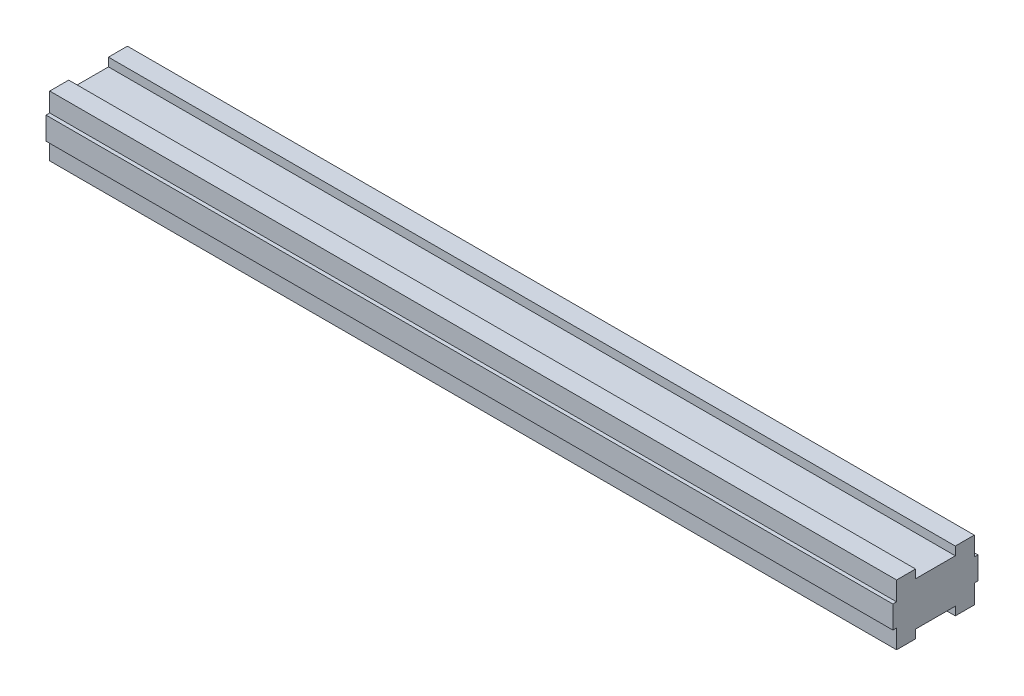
ISO-10303-21;
HEADER;
FILE_DESCRIPTION(('STEP AP214'),'2;1');
FILE_NAME('part.step','',(''),(''),'','','');
FILE_SCHEMA(('AUTOMOTIVE_DESIGN { 1 0 10303 214 1 1 1 1 }'));
ENDSEC;
DATA;
#1=APPLICATION_CONTEXT('core data for automotive mechanical design processes');
#2=APPLICATION_PROTOCOL_DEFINITION('international standard','automotive_design',2000,#1);
#3=PRODUCT_CONTEXT('',#1,'mechanical');
#4=PRODUCT('Part','Part','',(#3));
#5=PRODUCT_RELATED_PRODUCT_CATEGORY('part','',(#4));
#6=PRODUCT_DEFINITION_FORMATION('','',#4);
#7=PRODUCT_DEFINITION_CONTEXT('part definition',#1,'design');
#8=PRODUCT_DEFINITION('design','',#6,#7);
#9=PRODUCT_DEFINITION_SHAPE('','',#8);
#10=(LENGTH_UNIT() NAMED_UNIT(*) SI_UNIT(.MILLI.,.METRE.));
#11=(NAMED_UNIT(*) PLANE_ANGLE_UNIT() SI_UNIT($,.RADIAN.));
#12=(NAMED_UNIT(*) SI_UNIT($,.STERADIAN.) SOLID_ANGLE_UNIT());
#13=UNCERTAINTY_MEASURE_WITH_UNIT(LENGTH_MEASURE(1.E-05),#10,'distance_accuracy_value','');
#14=(GEOMETRIC_REPRESENTATION_CONTEXT(3) GLOBAL_UNCERTAINTY_ASSIGNED_CONTEXT((#13)) GLOBAL_UNIT_ASSIGNED_CONTEXT((#10,
#11,#12)) REPRESENTATION_CONTEXT('',''));
#15=CARTESIAN_POINT('',(0.,0.,0.));
#16=DIRECTION('',(0.,0.,1.));
#17=DIRECTION('',(1.,0.,0.));
#18=AXIS2_PLACEMENT_3D('',#15,#16,#17);
#19=CARTESIAN_POINT('',(165.1,11.8000000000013,-4.42500000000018));
#20=DIRECTION('',(0.,-1.,0.));
#21=DIRECTION('',(0.,0.,-1.));
#22=AXIS2_PLACEMENT_3D('',#19,#20,#21);
#23=PLANE('',#22);
#24=DIRECTION('',(0.,0.,1.));
#25=VECTOR('',#24,1.);
#26=CARTESIAN_POINT('',(0.,11.8000000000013,-4.42500000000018));
#27=LINE('',#26,#25);
#28=CARTESIAN_POINT('',(0.,11.8000000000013,-4.42500000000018));
#29=VERTEX_POINT('',#28);
#30=CARTESIAN_POINT('',(0.,11.8000000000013,-0.724999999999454));
#31=VERTEX_POINT('',#30);
#32=EDGE_CURVE('E181',#29,#31,#27,.T.);
#33=ORIENTED_EDGE('',*,*,#32,.T.);
#34=DIRECTION('',(-1.,0.,0.));
#35=VECTOR('',#34,1.);
#36=CARTESIAN_POINT('',(165.1,11.8000000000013,-0.724999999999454));
#37=LINE('',#36,#35);
#38=CARTESIAN_POINT('',(165.1,11.8000000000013,-0.724999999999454));
#39=VERTEX_POINT('',#38);
#40=EDGE_CURVE('E11',#39,#31,#37,.T.);
#41=ORIENTED_EDGE('',*,*,#40,.F.);
#42=DIRECTION('',(0.,0.,1.));
#43=VECTOR('',#42,1.);
#44=CARTESIAN_POINT('',(165.1,11.8000000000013,-4.42500000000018));
#45=LINE('',#44,#43);
#46=CARTESIAN_POINT('',(165.1,11.8000000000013,-4.42500000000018));
#47=VERTEX_POINT('',#46);
#48=EDGE_CURVE('E254',#47,#39,#45,.T.);
#49=ORIENTED_EDGE('',*,*,#48,.F.);
#50=DIRECTION('',(-1.,0.,0.));
#51=VECTOR('',#50,1.);
#52=CARTESIAN_POINT('',(165.1,11.8000000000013,-4.42500000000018));
#53=LINE('',#52,#51);
#54=EDGE_CURVE('E195',#47,#29,#53,.T.);
#55=ORIENTED_EDGE('',*,*,#54,.T.);
#56=EDGE_LOOP('',(#33,#41,#49,#55));
#57=FACE_BOUND('',#56,.T.);
#58=ADVANCED_FACE('F40',(#57),#23,.F.);
#59=CARTESIAN_POINT('',(165.1,11.8000000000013,-0.724999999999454));
#60=DIRECTION('',(0.,0.,-1.));
#61=DIRECTION('',(-1.,0.,0.));
#62=AXIS2_PLACEMENT_3D('',#59,#60,#61);
#63=PLANE('',#62);
#64=DIRECTION('',(0.,-1.,0.));
#65=VECTOR('',#64,1.);
#66=CARTESIAN_POINT('',(0.,11.8000000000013,-0.724999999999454));
#67=LINE('',#66,#65);
#68=CARTESIAN_POINT('',(0.,8.10000000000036,-0.724999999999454));
#69=VERTEX_POINT('',#68);
#70=EDGE_CURVE('E177',#31,#69,#67,.T.);
#71=ORIENTED_EDGE('',*,*,#70,.T.);
#72=DIRECTION('',(-1.,0.,0.));
#73=VECTOR('',#72,1.);
#74=CARTESIAN_POINT('',(165.1,8.10000000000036,-0.724999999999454));
#75=LINE('',#74,#73);
#76=CARTESIAN_POINT('',(165.1,8.10000000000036,-0.724999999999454));
#77=VERTEX_POINT('',#76);
#78=EDGE_CURVE('E48',#77,#69,#75,.T.);
#79=ORIENTED_EDGE('',*,*,#78,.F.);
#80=DIRECTION('',(0.,-1.,0.));
#81=VECTOR('',#80,1.);
#82=CARTESIAN_POINT('',(165.1,11.8000000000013,-0.724999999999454));
#83=LINE('',#82,#81);
#84=EDGE_CURVE('E191',#39,#77,#83,.T.);
#85=ORIENTED_EDGE('',*,*,#84,.F.);
#86=ORIENTED_EDGE('',*,*,#40,.T.);
#87=EDGE_LOOP('',(#71,#79,#85,#86));
#88=FACE_BOUND('',#87,.T.);
#89=ADVANCED_FACE('F190',(#88),#63,.F.);
#90=CARTESIAN_POINT('',(165.1,8.10000000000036,-0.724999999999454));
#91=DIRECTION('',(0.,-1.,0.));
#92=DIRECTION('',(0.,0.,-1.));
#93=AXIS2_PLACEMENT_3D('',#90,#91,#92);
#94=PLANE('',#93);
#95=DIRECTION('',(0.,0.,1.));
#96=VECTOR('',#95,1.);
#97=CARTESIAN_POINT('',(0.,8.10000000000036,-0.724999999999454));
#98=LINE('',#97,#96);
#99=CARTESIAN_POINT('',(0.,8.10000000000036,0.));
#100=VERTEX_POINT('',#99);
#101=EDGE_CURVE('E183',#69,#100,#98,.T.);
#102=ORIENTED_EDGE('',*,*,#101,.T.);
#103=DIRECTION('',(-1.,0.,0.));
#104=VECTOR('',#103,1.);
#105=CARTESIAN_POINT('',(165.1,8.10000000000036,0.));
#106=LINE('',#105,#104);
#107=CARTESIAN_POINT('',(165.1,8.10000000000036,0.));
#108=VERTEX_POINT('',#107);
#109=EDGE_CURVE('E375',#108,#100,#106,.T.);
#110=ORIENTED_EDGE('',*,*,#109,.F.);
#111=DIRECTION('',(0.,0.,1.));
#112=VECTOR('',#111,1.);
#113=CARTESIAN_POINT('',(165.1,8.10000000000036,-0.724999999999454));
#114=LINE('',#113,#112);
#115=EDGE_CURVE('E259',#77,#108,#114,.T.);
#116=ORIENTED_EDGE('',*,*,#115,.F.);
#117=ORIENTED_EDGE('',*,*,#78,.T.);
#118=EDGE_LOOP('',(#102,#110,#116,#117));
#119=FACE_BOUND('',#118,.T.);
#120=ADVANCED_FACE('F381',(#119),#94,.F.);
#121=CARTESIAN_POINT('',(165.1,8.10000000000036,0.));
#122=DIRECTION('',(0.,0.,-1.));
#123=DIRECTION('',(-1.,0.,0.));
#124=AXIS2_PLACEMENT_3D('',#121,#122,#123);
#125=PLANE('',#124);
#126=DIRECTION('',(0.,-1.,0.));
#127=VECTOR('',#126,1.);
#128=CARTESIAN_POINT('',(0.,8.10000000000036,0.));
#129=LINE('',#128,#127);
#130=CARTESIAN_POINT('',(0.,3.70000000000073,0.));
#131=VERTEX_POINT('',#130);
#132=EDGE_CURVE('E203',#100,#131,#129,.T.);
#133=ORIENTED_EDGE('',*,*,#132,.T.);
#134=DIRECTION('',(-1.,0.,0.));
#135=VECTOR('',#134,1.);
#136=CARTESIAN_POINT('',(165.1,3.70000000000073,0.));
#137=LINE('',#136,#135);
#138=CARTESIAN_POINT('',(165.1,3.70000000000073,0.));
#139=VERTEX_POINT('',#138);
#140=EDGE_CURVE('E371',#139,#131,#137,.T.);
#141=ORIENTED_EDGE('',*,*,#140,.F.);
#142=DIRECTION('',(0.,-1.,0.));
#143=VECTOR('',#142,1.);
#144=CARTESIAN_POINT('',(165.1,8.10000000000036,0.));
#145=LINE('',#144,#143);
#146=EDGE_CURVE('E261',#108,#139,#145,.T.);
#147=ORIENTED_EDGE('',*,*,#146,.F.);
#148=ORIENTED_EDGE('',*,*,#109,.T.);
#149=EDGE_LOOP('',(#133,#141,#147,#148));
#150=FACE_BOUND('',#149,.T.);
#151=ADVANCED_FACE('F389',(#150),#125,.F.);
#152=CARTESIAN_POINT('',(165.1,3.70000000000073,-0.724999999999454));
#153=DIRECTION('',(0.,1.,0.));
#154=DIRECTION('',(0.,0.,1.));
#155=AXIS2_PLACEMENT_3D('',#152,#153,#154);
#156=PLANE('',#155);
#157=DIRECTION('',(0.,0.,-1.));
#158=VECTOR('',#157,1.);
#159=CARTESIAN_POINT('',(0.,3.70000000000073,-0.724999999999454));
#160=LINE('',#159,#158);
#161=CARTESIAN_POINT('',(0.,3.70000000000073,-0.724999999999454));
#162=VERTEX_POINT('',#161);
#163=EDGE_CURVE('E206',#131,#162,#160,.T.);
#164=ORIENTED_EDGE('',*,*,#163,.T.);
#165=DIRECTION('',(-1.,0.,0.));
#166=VECTOR('',#165,1.);
#167=CARTESIAN_POINT('',(165.1,3.70000000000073,-0.724999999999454));
#168=LINE('',#167,#166);
#169=CARTESIAN_POINT('',(165.1,3.70000000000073,-0.724999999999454));
#170=VERTEX_POINT('',#169);
#171=EDGE_CURVE('E367',#170,#162,#168,.T.);
#172=ORIENTED_EDGE('',*,*,#171,.F.);
#173=DIRECTION('',(0.,0.,-1.));
#174=VECTOR('',#173,1.);
#175=CARTESIAN_POINT('',(165.1,3.70000000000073,-0.724999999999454));
#176=LINE('',#175,#174);
#177=EDGE_CURVE('E264',#139,#170,#176,.T.);
#178=ORIENTED_EDGE('',*,*,#177,.F.);
#179=ORIENTED_EDGE('',*,*,#140,.T.);
#180=EDGE_LOOP('',(#164,#172,#178,#179));
#181=FACE_BOUND('',#180,.T.);
#182=ADVANCED_FACE('F392',(#181),#156,.F.);
#183=CARTESIAN_POINT('',(165.1,3.70000000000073,-0.724999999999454));
#184=DIRECTION('',(0.,0.,-1.));
#185=DIRECTION('',(-1.,0.,0.));
#186=AXIS2_PLACEMENT_3D('',#183,#184,#185);
#187=PLANE('',#186);
#188=DIRECTION('',(0.,-1.,0.));
#189=VECTOR('',#188,1.);
#190=CARTESIAN_POINT('',(0.,3.70000000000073,-0.724999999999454));
#191=LINE('',#190,#189);
#192=CARTESIAN_POINT('',(0.,0.,-0.724999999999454));
#193=VERTEX_POINT('',#192);
#194=EDGE_CURVE('E209',#162,#193,#191,.T.);
#195=ORIENTED_EDGE('',*,*,#194,.T.);
#196=DIRECTION('',(-1.,0.,0.));
#197=VECTOR('',#196,1.);
#198=CARTESIAN_POINT('',(165.1,0.,-0.724999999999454));
#199=LINE('',#198,#197);
#200=CARTESIAN_POINT('',(165.1,0.,-0.724999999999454));
#201=VERTEX_POINT('',#200);
#202=EDGE_CURVE('E363',#201,#193,#199,.T.);
#203=ORIENTED_EDGE('',*,*,#202,.F.);
#204=DIRECTION('',(0.,-1.,0.));
#205=VECTOR('',#204,1.);
#206=CARTESIAN_POINT('',(165.1,3.70000000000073,-0.724999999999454));
#207=LINE('',#206,#205);
#208=EDGE_CURVE('E267',#170,#201,#207,.T.);
#209=ORIENTED_EDGE('',*,*,#208,.F.);
#210=ORIENTED_EDGE('',*,*,#171,.T.);
#211=EDGE_LOOP('',(#195,#203,#209,#210));
#212=FACE_BOUND('',#211,.T.);
#213=ADVANCED_FACE('F397',(#212),#187,.F.);
#214=CARTESIAN_POINT('',(165.1,0.,-4.42500000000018));
#215=DIRECTION('',(0.,1.,0.));
#216=DIRECTION('',(0.,0.,1.));
#217=AXIS2_PLACEMENT_3D('',#214,#215,#216);
#218=PLANE('',#217);
#219=DIRECTION('',(0.,0.,-1.));
#220=VECTOR('',#219,1.);
#221=CARTESIAN_POINT('',(0.,0.,-4.42500000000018));
#222=LINE('',#221,#220);
#223=CARTESIAN_POINT('',(0.,0.,-4.42500000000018));
#224=VERTEX_POINT('',#223);
#225=EDGE_CURVE('E212',#193,#224,#222,.T.);
#226=ORIENTED_EDGE('',*,*,#225,.T.);
#227=DIRECTION('',(-1.,0.,0.));
#228=VECTOR('',#227,1.);
#229=CARTESIAN_POINT('',(165.1,0.,-4.42500000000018));
#230=LINE('',#229,#228);
#231=CARTESIAN_POINT('',(165.1,0.,-4.42500000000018));
#232=VERTEX_POINT('',#231);
#233=EDGE_CURVE('E359',#232,#224,#230,.T.);
#234=ORIENTED_EDGE('',*,*,#233,.F.);
#235=DIRECTION('',(0.,0.,-1.));
#236=VECTOR('',#235,1.);
#237=CARTESIAN_POINT('',(165.1,0.,-4.42500000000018));
#238=LINE('',#237,#236);
#239=EDGE_CURVE('E270',#201,#232,#238,.T.);
#240=ORIENTED_EDGE('',*,*,#239,.F.);
#241=ORIENTED_EDGE('',*,*,#202,.T.);
#242=EDGE_LOOP('',(#226,#234,#240,#241));
#243=FACE_BOUND('',#242,.T.);
#244=ADVANCED_FACE('F403',(#243),#218,.F.);
#245=CARTESIAN_POINT('',(165.1,1.65000000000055,-4.42500000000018));
#246=DIRECTION('',(0.,0.,1.));
#247=DIRECTION('',(1.,0.,0.));
#248=AXIS2_PLACEMENT_3D('',#245,#246,#247);
#249=PLANE('',#248);
#250=DIRECTION('',(0.,1.,0.));
#251=VECTOR('',#250,1.);
#252=CARTESIAN_POINT('',(0.,1.65000000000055,-4.42500000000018));
#253=LINE('',#252,#251);
#254=CARTESIAN_POINT('',(0.,1.65000000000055,-4.42500000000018));
#255=VERTEX_POINT('',#254);
#256=EDGE_CURVE('E215',#224,#255,#253,.T.);
#257=ORIENTED_EDGE('',*,*,#256,.T.);
#258=DIRECTION('',(-1.,0.,0.));
#259=VECTOR('',#258,1.);
#260=CARTESIAN_POINT('',(165.1,1.65000000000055,-4.42500000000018));
#261=LINE('',#260,#259);
#262=CARTESIAN_POINT('',(165.1,1.65000000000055,-4.42500000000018));
#263=VERTEX_POINT('',#262);
#264=EDGE_CURVE('E355',#263,#255,#261,.T.);
#265=ORIENTED_EDGE('',*,*,#264,.F.);
#266=DIRECTION('',(0.,1.,0.));
#267=VECTOR('',#266,1.);
#268=CARTESIAN_POINT('',(165.1,1.65000000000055,-4.42500000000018));
#269=LINE('',#268,#267);
#270=EDGE_CURVE('E273',#232,#263,#269,.T.);
#271=ORIENTED_EDGE('',*,*,#270,.F.);
#272=ORIENTED_EDGE('',*,*,#233,.T.);
#273=EDGE_LOOP('',(#257,#265,#271,#272));
#274=FACE_BOUND('',#273,.T.);
#275=ADVANCED_FACE('F407',(#274),#249,.F.);
#276=CARTESIAN_POINT('',(165.1,1.65000000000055,-4.42500000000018));
#277=DIRECTION('',(0.,1.,0.));
#278=DIRECTION('',(0.,0.,1.));
#279=AXIS2_PLACEMENT_3D('',#276,#277,#278);
#280=PLANE('',#279);
#281=DIRECTION('',(0.,0.,-1.));
#282=VECTOR('',#281,1.);
#283=CARTESIAN_POINT('',(0.,1.65000000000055,-4.42500000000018));
#284=LINE('',#283,#282);
#285=CARTESIAN_POINT('',(0.,1.65000000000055,-12.1750000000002));
#286=VERTEX_POINT('',#285);
#287=EDGE_CURVE('E218',#255,#286,#284,.T.);
#288=ORIENTED_EDGE('',*,*,#287,.T.);
#289=DIRECTION('',(-1.,0.,0.));
#290=VECTOR('',#289,1.);
#291=CARTESIAN_POINT('',(165.1,1.65000000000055,-12.1750000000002));
#292=LINE('',#291,#290);
#293=CARTESIAN_POINT('',(165.1,1.65000000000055,-12.1750000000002));
#294=VERTEX_POINT('',#293);
#295=EDGE_CURVE('E351',#294,#286,#292,.T.);
#296=ORIENTED_EDGE('',*,*,#295,.F.);
#297=DIRECTION('',(0.,0.,-1.));
#298=VECTOR('',#297,1.);
#299=CARTESIAN_POINT('',(165.1,1.65000000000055,-4.42500000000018));
#300=LINE('',#299,#298);
#301=EDGE_CURVE('E276',#263,#294,#300,.T.);
#302=ORIENTED_EDGE('',*,*,#301,.F.);
#303=ORIENTED_EDGE('',*,*,#264,.T.);
#304=EDGE_LOOP('',(#288,#296,#302,#303));
#305=FACE_BOUND('',#304,.T.);
#306=ADVANCED_FACE('F412',(#305),#280,.F.);
#307=CARTESIAN_POINT('',(165.1,1.65000000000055,-12.1750000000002));
#308=DIRECTION('',(0.,0.,-1.));
#309=DIRECTION('',(-1.,0.,0.));
#310=AXIS2_PLACEMENT_3D('',#307,#308,#309);
#311=PLANE('',#310);
#312=DIRECTION('',(0.,-1.,0.));
#313=VECTOR('',#312,1.);
#314=CARTESIAN_POINT('',(0.,1.65000000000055,-12.1750000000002));
#315=LINE('',#314,#313);
#316=CARTESIAN_POINT('',(0.,2.27373675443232E-13,-12.1750000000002));
#317=VERTEX_POINT('',#316);
#318=EDGE_CURVE('E221',#286,#317,#315,.T.);
#319=ORIENTED_EDGE('',*,*,#318,.T.);
#320=DIRECTION('',(-1.,0.,0.));
#321=VECTOR('',#320,1.);
#322=CARTESIAN_POINT('',(165.1,2.27373675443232E-13,-12.1750000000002));
#323=LINE('',#322,#321);
#324=CARTESIAN_POINT('',(165.1,2.27373675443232E-13,-12.1750000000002));
#325=VERTEX_POINT('',#324);
#326=EDGE_CURVE('E347',#325,#317,#323,.T.);
#327=ORIENTED_EDGE('',*,*,#326,.F.);
#328=DIRECTION('',(0.,-1.,0.));
#329=VECTOR('',#328,1.);
#330=CARTESIAN_POINT('',(165.1,1.65000000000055,-12.1750000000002));
#331=LINE('',#330,#329);
#332=EDGE_CURVE('E279',#294,#325,#331,.T.);
#333=ORIENTED_EDGE('',*,*,#332,.F.);
#334=ORIENTED_EDGE('',*,*,#295,.T.);
#335=EDGE_LOOP('',(#319,#327,#333,#334));
#336=FACE_BOUND('',#335,.T.);
#337=ADVANCED_FACE('F418',(#336),#311,.F.);
#338=CARTESIAN_POINT('',(165.1,2.27373675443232E-13,-12.1750000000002));
#339=DIRECTION('',(0.,1.,0.));
#340=DIRECTION('',(0.,0.,1.));
#341=AXIS2_PLACEMENT_3D('',#338,#339,#340);
#342=PLANE('',#341);
#343=DIRECTION('',(0.,0.,-1.));
#344=VECTOR('',#343,1.);
#345=CARTESIAN_POINT('',(0.,2.27373675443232E-13,-12.1750000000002));
#346=LINE('',#345,#344);
#347=CARTESIAN_POINT('',(0.,2.27373675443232E-13,-15.875));
#348=VERTEX_POINT('',#347);
#349=EDGE_CURVE('E224',#317,#348,#346,.T.);
#350=ORIENTED_EDGE('',*,*,#349,.T.);
#351=DIRECTION('',(-1.,0.,0.));
#352=VECTOR('',#351,1.);
#353=CARTESIAN_POINT('',(165.1,2.27373675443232E-13,-15.875));
#354=LINE('',#353,#352);
#355=CARTESIAN_POINT('',(165.1,2.27373675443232E-13,-15.875));
#356=VERTEX_POINT('',#355);
#357=EDGE_CURVE('E344',#356,#348,#354,.T.);
#358=ORIENTED_EDGE('',*,*,#357,.F.);
#359=DIRECTION('',(0.,0.,-1.));
#360=VECTOR('',#359,1.);
#361=CARTESIAN_POINT('',(165.1,2.27373675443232E-13,-12.1750000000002));
#362=LINE('',#361,#360);
#363=EDGE_CURVE('E282',#325,#356,#362,.T.);
#364=ORIENTED_EDGE('',*,*,#363,.F.);
#365=ORIENTED_EDGE('',*,*,#326,.T.);
#366=EDGE_LOOP('',(#350,#358,#364,#365));
#367=FACE_BOUND('',#366,.T.);
#368=ADVANCED_FACE('F422',(#367),#342,.F.);
#369=CARTESIAN_POINT('',(165.1,3.70000000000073,-15.875));
#370=DIRECTION('',(0.,0.,1.));
#371=DIRECTION('',(1.,0.,0.));
#372=AXIS2_PLACEMENT_3D('',#369,#370,#371);
#373=PLANE('',#372);
#374=DIRECTION('',(0.,1.,0.));
#375=VECTOR('',#374,1.);
#376=CARTESIAN_POINT('',(0.,3.70000000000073,-15.875));
#377=LINE('',#376,#375);
#378=CARTESIAN_POINT('',(0.,3.70000000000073,-15.875));
#379=VERTEX_POINT('',#378);
#380=EDGE_CURVE('E227',#348,#379,#377,.T.);
#381=ORIENTED_EDGE('',*,*,#380,.T.);
#382=DIRECTION('',(-1.,0.,0.));
#383=VECTOR('',#382,1.);
#384=CARTESIAN_POINT('',(165.1,3.70000000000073,-15.875));
#385=LINE('',#384,#383);
#386=CARTESIAN_POINT('',(165.1,3.70000000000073,-15.875));
#387=VERTEX_POINT('',#386);
#388=EDGE_CURVE('E340',#387,#379,#385,.T.);
#389=ORIENTED_EDGE('',*,*,#388,.F.);
#390=DIRECTION('',(0.,1.,0.));
#391=VECTOR('',#390,1.);
#392=CARTESIAN_POINT('',(165.1,3.70000000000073,-15.875));
#393=LINE('',#392,#391);
#394=EDGE_CURVE('E285',#356,#387,#393,.T.);
#395=ORIENTED_EDGE('',*,*,#394,.F.);
#396=ORIENTED_EDGE('',*,*,#357,.T.);
#397=EDGE_LOOP('',(#381,#389,#395,#396));
#398=FACE_BOUND('',#397,.T.);
#399=ADVANCED_FACE('F427',(#398),#373,.F.);
#400=CARTESIAN_POINT('',(165.1,3.70000000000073,-15.875));
#401=DIRECTION('',(0.,1.,0.));
#402=DIRECTION('',(0.,0.,1.));
#403=AXIS2_PLACEMENT_3D('',#400,#401,#402);
#404=PLANE('',#403);
#405=DIRECTION('',(0.,0.,-1.));
#406=VECTOR('',#405,1.);
#407=CARTESIAN_POINT('',(0.,3.70000000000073,-15.875));
#408=LINE('',#407,#406);
#409=CARTESIAN_POINT('',(0.,3.70000000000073,-16.5999999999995));
#410=VERTEX_POINT('',#409);
#411=EDGE_CURVE('E230',#379,#410,#408,.T.);
#412=ORIENTED_EDGE('',*,*,#411,.T.);
#413=DIRECTION('',(-1.,0.,0.));
#414=VECTOR('',#413,1.);
#415=CARTESIAN_POINT('',(165.1,3.70000000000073,-16.5999999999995));
#416=LINE('',#415,#414);
#417=CARTESIAN_POINT('',(165.1,3.70000000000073,-16.5999999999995));
#418=VERTEX_POINT('',#417);
#419=EDGE_CURVE('E336',#418,#410,#416,.T.);
#420=ORIENTED_EDGE('',*,*,#419,.F.);
#421=DIRECTION('',(0.,0.,-1.));
#422=VECTOR('',#421,1.);
#423=CARTESIAN_POINT('',(165.1,3.70000000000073,-15.875));
#424=LINE('',#423,#422);
#425=EDGE_CURVE('E288',#387,#418,#424,.T.);
#426=ORIENTED_EDGE('',*,*,#425,.F.);
#427=ORIENTED_EDGE('',*,*,#388,.T.);
#428=EDGE_LOOP('',(#412,#420,#426,#427));
#429=FACE_BOUND('',#428,.T.);
#430=ADVANCED_FACE('F433',(#429),#404,.F.);
#431=CARTESIAN_POINT('',(165.1,8.10000000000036,-16.5999999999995));
#432=DIRECTION('',(0.,0.,1.));
#433=DIRECTION('',(1.,0.,0.));
#434=AXIS2_PLACEMENT_3D('',#431,#432,#433);
#435=PLANE('',#434);
#436=DIRECTION('',(0.,1.,0.));
#437=VECTOR('',#436,1.);
#438=CARTESIAN_POINT('',(0.,8.10000000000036,-16.5999999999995));
#439=LINE('',#438,#437);
#440=CARTESIAN_POINT('',(0.,8.10000000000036,-16.5999999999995));
#441=VERTEX_POINT('',#440);
#442=EDGE_CURVE('E233',#410,#441,#439,.T.);
#443=ORIENTED_EDGE('',*,*,#442,.T.);
#444=DIRECTION('',(-1.,0.,0.));
#445=VECTOR('',#444,1.);
#446=CARTESIAN_POINT('',(165.1,8.10000000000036,-16.5999999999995));
#447=LINE('',#446,#445);
#448=CARTESIAN_POINT('',(165.1,8.10000000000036,-16.5999999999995));
#449=VERTEX_POINT('',#448);
#450=EDGE_CURVE('E332',#449,#441,#447,.T.);
#451=ORIENTED_EDGE('',*,*,#450,.F.);
#452=DIRECTION('',(0.,1.,0.));
#453=VECTOR('',#452,1.);
#454=CARTESIAN_POINT('',(165.1,8.10000000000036,-16.5999999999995));
#455=LINE('',#454,#453);
#456=EDGE_CURVE('E291',#418,#449,#455,.T.);
#457=ORIENTED_EDGE('',*,*,#456,.F.);
#458=ORIENTED_EDGE('',*,*,#419,.T.);
#459=EDGE_LOOP('',(#443,#451,#457,#458));
#460=FACE_BOUND('',#459,.T.);
#461=ADVANCED_FACE('F437',(#460),#435,.F.);
#462=CARTESIAN_POINT('',(165.1,8.10000000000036,-15.875));
#463=DIRECTION('',(0.,-1.,0.));
#464=DIRECTION('',(0.,0.,-1.));
#465=AXIS2_PLACEMENT_3D('',#462,#463,#464);
#466=PLANE('',#465);
#467=DIRECTION('',(0.,0.,1.));
#468=VECTOR('',#467,1.);
#469=CARTESIAN_POINT('',(0.,8.10000000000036,-15.875));
#470=LINE('',#469,#468);
#471=CARTESIAN_POINT('',(0.,8.10000000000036,-15.875));
#472=VERTEX_POINT('',#471);
#473=EDGE_CURVE('E236',#441,#472,#470,.T.);
#474=ORIENTED_EDGE('',*,*,#473,.T.);
#475=DIRECTION('',(-1.,0.,0.));
#476=VECTOR('',#475,1.);
#477=CARTESIAN_POINT('',(165.1,8.10000000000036,-15.875));
#478=LINE('',#477,#476);
#479=CARTESIAN_POINT('',(165.1,8.10000000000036,-15.875));
#480=VERTEX_POINT('',#479);
#481=EDGE_CURVE('E328',#480,#472,#478,.T.);
#482=ORIENTED_EDGE('',*,*,#481,.F.);
#483=DIRECTION('',(0.,0.,1.));
#484=VECTOR('',#483,1.);
#485=CARTESIAN_POINT('',(165.1,8.10000000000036,-15.875));
#486=LINE('',#485,#484);
#487=EDGE_CURVE('E294',#449,#480,#486,.T.);
#488=ORIENTED_EDGE('',*,*,#487,.F.);
#489=ORIENTED_EDGE('',*,*,#450,.T.);
#490=EDGE_LOOP('',(#474,#482,#488,#489));
#491=FACE_BOUND('',#490,.T.);
#492=ADVANCED_FACE('F442',(#491),#466,.F.);
#493=CARTESIAN_POINT('',(165.1,11.8000000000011,-15.875));
#494=DIRECTION('',(0.,0.,1.));
#495=DIRECTION('',(1.,0.,0.));
#496=AXIS2_PLACEMENT_3D('',#493,#494,#495);
#497=PLANE('',#496);
#498=DIRECTION('',(0.,1.,0.));
#499=VECTOR('',#498,1.);
#500=CARTESIAN_POINT('',(0.,11.8000000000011,-15.875));
#501=LINE('',#500,#499);
#502=CARTESIAN_POINT('',(0.,11.8000000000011,-15.875));
#503=VERTEX_POINT('',#502);
#504=EDGE_CURVE('E239',#472,#503,#501,.T.);
#505=ORIENTED_EDGE('',*,*,#504,.T.);
#506=DIRECTION('',(-1.,0.,0.));
#507=VECTOR('',#506,1.);
#508=CARTESIAN_POINT('',(165.1,11.8000000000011,-15.875));
#509=LINE('',#508,#507);
#510=CARTESIAN_POINT('',(165.1,11.8000000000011,-15.875));
#511=VERTEX_POINT('',#510);
#512=EDGE_CURVE('E324',#511,#503,#509,.T.);
#513=ORIENTED_EDGE('',*,*,#512,.F.);
#514=DIRECTION('',(0.,1.,0.));
#515=VECTOR('',#514,1.);
#516=CARTESIAN_POINT('',(165.1,11.8000000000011,-15.875));
#517=LINE('',#516,#515);
#518=EDGE_CURVE('E297',#480,#511,#517,.T.);
#519=ORIENTED_EDGE('',*,*,#518,.F.);
#520=ORIENTED_EDGE('',*,*,#481,.T.);
#521=EDGE_LOOP('',(#505,#513,#519,#520));
#522=FACE_BOUND('',#521,.T.);
#523=ADVANCED_FACE('F448',(#522),#497,.F.);
#524=CARTESIAN_POINT('',(165.1,11.8000000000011,-12.1750000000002));
#525=DIRECTION('',(0.,-1.,0.));
#526=DIRECTION('',(0.,0.,-1.));
#527=AXIS2_PLACEMENT_3D('',#524,#525,#526);
#528=PLANE('',#527);
#529=DIRECTION('',(0.,0.,1.));
#530=VECTOR('',#529,1.);
#531=CARTESIAN_POINT('',(0.,11.8000000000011,-12.1750000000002));
#532=LINE('',#531,#530);
#533=CARTESIAN_POINT('',(0.,11.8000000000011,-12.1750000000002));
#534=VERTEX_POINT('',#533);
#535=EDGE_CURVE('E242',#503,#534,#532,.T.);
#536=ORIENTED_EDGE('',*,*,#535,.T.);
#537=DIRECTION('',(-1.,0.,0.));
#538=VECTOR('',#537,1.);
#539=CARTESIAN_POINT('',(165.1,11.8000000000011,-12.1750000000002));
#540=LINE('',#539,#538);
#541=CARTESIAN_POINT('',(165.1,11.8000000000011,-12.1750000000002));
#542=VERTEX_POINT('',#541);
#543=EDGE_CURVE('E320',#542,#534,#540,.T.);
#544=ORIENTED_EDGE('',*,*,#543,.F.);
#545=DIRECTION('',(0.,0.,1.));
#546=VECTOR('',#545,1.);
#547=CARTESIAN_POINT('',(165.1,11.8000000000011,-12.1750000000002));
#548=LINE('',#547,#546);
#549=EDGE_CURVE('E300',#511,#542,#548,.T.);
#550=ORIENTED_EDGE('',*,*,#549,.F.);
#551=ORIENTED_EDGE('',*,*,#512,.T.);
#552=EDGE_LOOP('',(#536,#544,#550,#551));
#553=FACE_BOUND('',#552,.T.);
#554=ADVANCED_FACE('F452',(#553),#528,.F.);
#555=CARTESIAN_POINT('',(165.1,11.8000000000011,-12.1750000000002));
#556=DIRECTION('',(0.,0.,-1.));
#557=DIRECTION('',(-1.,0.,0.));
#558=AXIS2_PLACEMENT_3D('',#555,#556,#557);
#559=PLANE('',#558);
#560=DIRECTION('',(0.,-1.,0.));
#561=VECTOR('',#560,1.);
#562=CARTESIAN_POINT('',(0.,11.8000000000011,-12.1750000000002));
#563=LINE('',#562,#561);
#564=CARTESIAN_POINT('',(0.,10.1500000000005,-12.1750000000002));
#565=VERTEX_POINT('',#564);
#566=EDGE_CURVE('E245',#534,#565,#563,.T.);
#567=ORIENTED_EDGE('',*,*,#566,.T.);
#568=DIRECTION('',(-1.,0.,0.));
#569=VECTOR('',#568,1.);
#570=CARTESIAN_POINT('',(165.1,10.1500000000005,-12.1750000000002));
#571=LINE('',#570,#569);
#572=CARTESIAN_POINT('',(165.1,10.1500000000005,-12.1750000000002));
#573=VERTEX_POINT('',#572);
#574=EDGE_CURVE('E316',#573,#565,#571,.T.);
#575=ORIENTED_EDGE('',*,*,#574,.F.);
#576=DIRECTION('',(0.,-1.,0.));
#577=VECTOR('',#576,1.);
#578=CARTESIAN_POINT('',(165.1,11.8000000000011,-12.1750000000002));
#579=LINE('',#578,#577);
#580=EDGE_CURVE('E303',#542,#573,#579,.T.);
#581=ORIENTED_EDGE('',*,*,#580,.F.);
#582=ORIENTED_EDGE('',*,*,#543,.T.);
#583=EDGE_LOOP('',(#567,#575,#581,#582));
#584=FACE_BOUND('',#583,.T.);
#585=ADVANCED_FACE('F457',(#584),#559,.F.);
#586=CARTESIAN_POINT('',(165.1,10.1500000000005,-4.42500000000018));
#587=DIRECTION('',(0.,-1.,0.));
#588=DIRECTION('',(0.,0.,-1.));
#589=AXIS2_PLACEMENT_3D('',#586,#587,#588);
#590=PLANE('',#589);
#591=DIRECTION('',(0.,0.,1.));
#592=VECTOR('',#591,1.);
#593=CARTESIAN_POINT('',(0.,10.1500000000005,-4.42500000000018));
#594=LINE('',#593,#592);
#595=CARTESIAN_POINT('',(0.,10.1500000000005,-4.42500000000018));
#596=VERTEX_POINT('',#595);
#597=EDGE_CURVE('E248',#565,#596,#594,.T.);
#598=ORIENTED_EDGE('',*,*,#597,.T.);
#599=DIRECTION('',(-1.,0.,0.));
#600=VECTOR('',#599,1.);
#601=CARTESIAN_POINT('',(165.1,10.1500000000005,-4.42500000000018));
#602=LINE('',#601,#600);
#603=CARTESIAN_POINT('',(165.1,10.1500000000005,-4.42500000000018));
#604=VERTEX_POINT('',#603);
#605=EDGE_CURVE('E312',#604,#596,#602,.T.);
#606=ORIENTED_EDGE('',*,*,#605,.F.);
#607=DIRECTION('',(0.,0.,1.));
#608=VECTOR('',#607,1.);
#609=CARTESIAN_POINT('',(165.1,10.1500000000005,-4.42500000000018));
#610=LINE('',#609,#608);
#611=EDGE_CURVE('E60',#573,#604,#610,.T.);
#612=ORIENTED_EDGE('',*,*,#611,.F.);
#613=ORIENTED_EDGE('',*,*,#574,.T.);
#614=EDGE_LOOP('',(#598,#606,#612,#613));
#615=FACE_BOUND('',#614,.T.);
#616=ADVANCED_FACE('F460',(#615),#590,.F.);
#617=CARTESIAN_POINT('',(165.1,11.8000000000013,-4.42500000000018));
#618=DIRECTION('',(0.,0.,1.));
#619=DIRECTION('',(1.,0.,0.));
#620=AXIS2_PLACEMENT_3D('',#617,#618,#619);
#621=PLANE('',#620);
#622=DIRECTION('',(0.,1.,0.));
#623=VECTOR('',#622,1.);
#624=CARTESIAN_POINT('',(0.,11.8000000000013,-4.42500000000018));
#625=LINE('',#624,#623);
#626=EDGE_CURVE('E251',#596,#29,#625,.T.);
#627=ORIENTED_EDGE('',*,*,#626,.T.);
#628=ORIENTED_EDGE('',*,*,#54,.F.);
#629=DIRECTION('',(0.,1.,0.));
#630=VECTOR('',#629,1.);
#631=CARTESIAN_POINT('',(165.1,11.8000000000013,-4.42500000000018));
#632=LINE('',#631,#630);
#633=EDGE_CURVE('E55',#604,#47,#632,.T.);
#634=ORIENTED_EDGE('',*,*,#633,.F.);
#635=ORIENTED_EDGE('',*,*,#605,.T.);
#636=EDGE_LOOP('',(#627,#628,#634,#635));
#637=FACE_BOUND('',#636,.T.);
#638=ADVANCED_FACE('F462',(#637),#621,.F.);
#639=CARTESIAN_POINT('',(165.1,11.8000000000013,-0.724999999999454));
#640=DIRECTION('',(1.,0.,0.));
#641=DIRECTION('',(0.,0.,-1.));
#642=AXIS2_PLACEMENT_3D('',#639,#640,#641);
#643=PLANE('',#642);
#644=ORIENTED_EDGE('',*,*,#48,.T.);
#645=ORIENTED_EDGE('',*,*,#84,.T.);
#646=ORIENTED_EDGE('',*,*,#115,.T.);
#647=ORIENTED_EDGE('',*,*,#146,.T.);
#648=ORIENTED_EDGE('',*,*,#177,.T.);
#649=ORIENTED_EDGE('',*,*,#208,.T.);
#650=ORIENTED_EDGE('',*,*,#239,.T.);
#651=ORIENTED_EDGE('',*,*,#270,.T.);
#652=ORIENTED_EDGE('',*,*,#301,.T.);
#653=ORIENTED_EDGE('',*,*,#332,.T.);
#654=ORIENTED_EDGE('',*,*,#363,.T.);
#655=ORIENTED_EDGE('',*,*,#394,.T.);
#656=ORIENTED_EDGE('',*,*,#425,.T.);
#657=ORIENTED_EDGE('',*,*,#456,.T.);
#658=ORIENTED_EDGE('',*,*,#487,.T.);
#659=ORIENTED_EDGE('',*,*,#518,.T.);
#660=ORIENTED_EDGE('',*,*,#549,.T.);
#661=ORIENTED_EDGE('',*,*,#580,.T.);
#662=ORIENTED_EDGE('',*,*,#611,.T.);
#663=ORIENTED_EDGE('',*,*,#633,.T.);
#664=EDGE_LOOP('',(#644,#645,#646,#647,#648,#649,#650,#651,#652,#653,#654,#655,#656,#657,#658,
#659,#660,#661,#662,#663));
#665=FACE_BOUND('',#664,.T.);
#666=ADVANCED_FACE('F384',(#665),#643,.T.);
#667=CARTESIAN_POINT('',(0.,11.8000000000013,-0.724999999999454));
#668=DIRECTION('',(1.,0.,0.));
#669=DIRECTION('',(0.,0.,-1.));
#670=AXIS2_PLACEMENT_3D('',#667,#668,#669);
#671=PLANE('',#670);
#672=ORIENTED_EDGE('',*,*,#32,.F.);
#673=ORIENTED_EDGE('',*,*,#626,.F.);
#674=ORIENTED_EDGE('',*,*,#597,.F.);
#675=ORIENTED_EDGE('',*,*,#566,.F.);
#676=ORIENTED_EDGE('',*,*,#535,.F.);
#677=ORIENTED_EDGE('',*,*,#504,.F.);
#678=ORIENTED_EDGE('',*,*,#473,.F.);
#679=ORIENTED_EDGE('',*,*,#442,.F.);
#680=ORIENTED_EDGE('',*,*,#411,.F.);
#681=ORIENTED_EDGE('',*,*,#380,.F.);
#682=ORIENTED_EDGE('',*,*,#349,.F.);
#683=ORIENTED_EDGE('',*,*,#318,.F.);
#684=ORIENTED_EDGE('',*,*,#287,.F.);
#685=ORIENTED_EDGE('',*,*,#256,.F.);
#686=ORIENTED_EDGE('',*,*,#225,.F.);
#687=ORIENTED_EDGE('',*,*,#194,.F.);
#688=ORIENTED_EDGE('',*,*,#163,.F.);
#689=ORIENTED_EDGE('',*,*,#132,.F.);
#690=ORIENTED_EDGE('',*,*,#101,.F.);
#691=ORIENTED_EDGE('',*,*,#70,.F.);
#692=EDGE_LOOP('',(#672,#673,#674,#675,#676,#677,#678,#679,#680,#681,#682,#683,#684,#685,#686,
#687,#688,#689,#690,#691));
#693=FACE_BOUND('',#692,.T.);
#694=ADVANCED_FACE('F178',(#693),#671,.F.);
#695=CLOSED_SHELL('',(#58,#89,#120,#151,#182,#213,#244,#275,#306,#337,#368,#399,#430,#461,#492,
#523,#554,#585,#616,#638,#666,#694));
#696=MANIFOLD_SOLID_BREP('B2',#695);
#697=ADVANCED_BREP_SHAPE_REPRESENTATION('',(#18,#696),#14);
#698=SHAPE_DEFINITION_REPRESENTATION(#9,#697);
ENDSEC;
END-ISO-10303-21;
